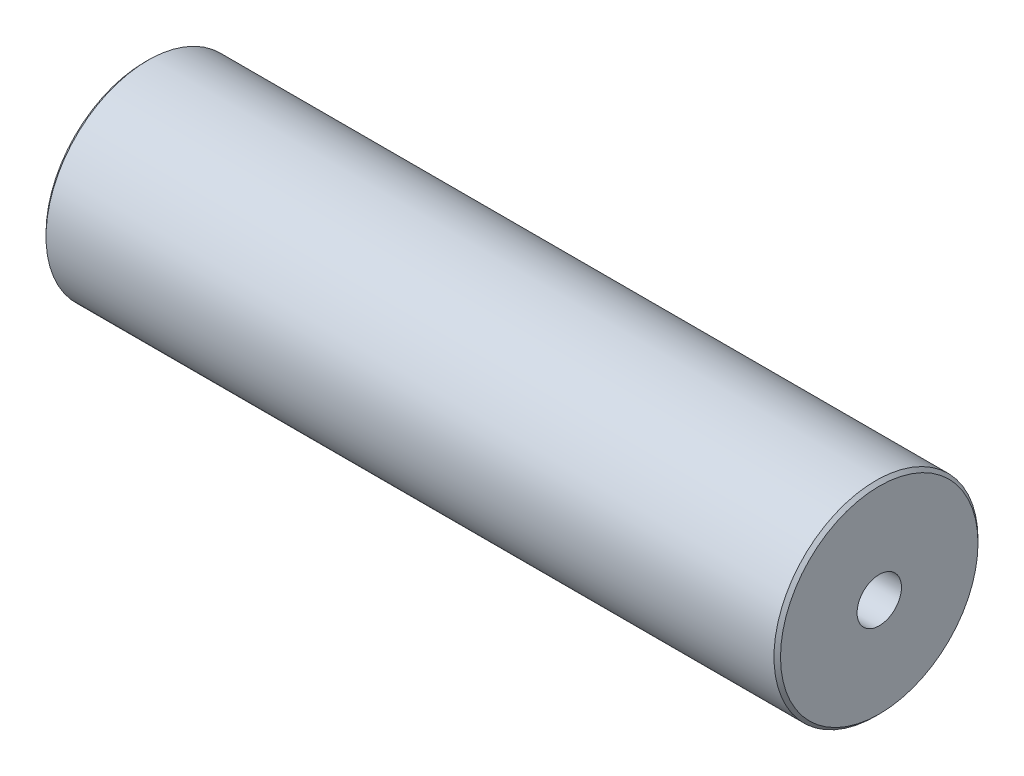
ISO-10303-21;
HEADER;
FILE_DESCRIPTION(('STEP AP214'),'2;1');
FILE_NAME('part.step','',(''),(''),'','','');
FILE_SCHEMA(('AUTOMOTIVE_DESIGN { 1 0 10303 214 1 1 1 1 }'));
ENDSEC;
DATA;
#1=APPLICATION_CONTEXT('core data for automotive mechanical design processes');
#2=APPLICATION_PROTOCOL_DEFINITION('international standard','automotive_design',2000,#1);
#3=PRODUCT_CONTEXT('',#1,'mechanical');
#4=PRODUCT('Part','Part','',(#3));
#5=PRODUCT_RELATED_PRODUCT_CATEGORY('part','',(#4));
#6=PRODUCT_DEFINITION_FORMATION('','',#4);
#7=PRODUCT_DEFINITION_CONTEXT('part definition',#1,'design');
#8=PRODUCT_DEFINITION('design','',#6,#7);
#9=PRODUCT_DEFINITION_SHAPE('','',#8);
#10=(LENGTH_UNIT() NAMED_UNIT(*) SI_UNIT(.MILLI.,.METRE.));
#11=(NAMED_UNIT(*) PLANE_ANGLE_UNIT() SI_UNIT($,.RADIAN.));
#12=(NAMED_UNIT(*) SI_UNIT($,.STERADIAN.) SOLID_ANGLE_UNIT());
#13=UNCERTAINTY_MEASURE_WITH_UNIT(LENGTH_MEASURE(1.E-05),#10,'distance_accuracy_value','');
#14=(GEOMETRIC_REPRESENTATION_CONTEXT(3) GLOBAL_UNCERTAINTY_ASSIGNED_CONTEXT((#13)) GLOBAL_UNIT_ASSIGNED_CONTEXT((#10,
#11,#12)) REPRESENTATION_CONTEXT('',''));
#15=CARTESIAN_POINT('',(0.,0.,0.));
#16=DIRECTION('',(0.,0.,1.));
#17=DIRECTION('',(1.,0.,0.));
#18=AXIS2_PLACEMENT_3D('',#15,#16,#17);
#19=CARTESIAN_POINT('',(28.575,0.,0.));
#20=DIRECTION('',(-1.,0.,0.));
#21=DIRECTION('',(0.,0.,1.));
#22=AXIS2_PLACEMENT_3D('',#19,#20,#21);
#23=CYLINDRICAL_SURFACE('',#22,7.9375);
#24=CARTESIAN_POINT('',(-28.321,0.,0.));
#25=DIRECTION('',(1.,0.,0.));
#26=DIRECTION('',(0.,0.,-1.));
#27=AXIS2_PLACEMENT_3D('',#24,#25,#26);
#28=CIRCLE('',#27,7.9375);
#29=CARTESIAN_POINT('',(-28.321,0.,-7.9375));
#30=VERTEX_POINT('',#29);
#31=EDGE_CURVE('E77',#30,#30,#28,.T.);
#32=ORIENTED_EDGE('',*,*,#31,.T.);
#33=EDGE_LOOP('',(#32));
#34=FACE_BOUND('',#33,.T.);
#35=CARTESIAN_POINT('',(28.321,0.,0.));
#36=DIRECTION('',(1.,0.,0.));
#37=DIRECTION('',(0.,0.,-1.));
#38=AXIS2_PLACEMENT_3D('',#35,#36,#37);
#39=CIRCLE('',#38,7.9375);
#40=CARTESIAN_POINT('',(28.321,0.,-7.9375));
#41=VERTEX_POINT('',#40);
#42=EDGE_CURVE('E74',#41,#41,#39,.F.);
#43=ORIENTED_EDGE('',*,*,#42,.T.);
#44=EDGE_LOOP('',(#43));
#45=FACE_BOUND('',#44,.T.);
#46=ADVANCED_FACE('F39',(#34,#45),#23,.T.);
#47=CARTESIAN_POINT('',(28.575,0.,0.));
#48=DIRECTION('',(1.,0.,0.));
#49=DIRECTION('',(0.,0.,-1.));
#50=AXIS2_PLACEMENT_3D('',#47,#48,#49);
#51=PLANE('',#50);
#52=CARTESIAN_POINT('',(28.575,0.,0.));
#53=DIRECTION('',(1.,0.,0.));
#54=DIRECTION('',(0.,0.,-1.));
#55=AXIS2_PLACEMENT_3D('',#52,#53,#54);
#56=CIRCLE('',#55,7.68350000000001);
#57=CARTESIAN_POINT('',(28.575,0.,-7.68350000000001));
#58=VERTEX_POINT('',#57);
#59=EDGE_CURVE('E11',#58,#58,#56,.T.);
#60=ORIENTED_EDGE('',*,*,#59,.T.);
#61=EDGE_LOOP('',(#60));
#62=FACE_BOUND('',#61,.T.);
#63=CARTESIAN_POINT('',(28.575,0.,0.));
#64=DIRECTION('',(1.,0.,0.));
#65=DIRECTION('',(0.,0.,-1.));
#66=AXIS2_PLACEMENT_3D('',#63,#64,#65);
#67=CIRCLE('',#66,1.7272);
#68=CARTESIAN_POINT('',(28.575,0.,-1.7272));
#69=VERTEX_POINT('',#68);
#70=EDGE_CURVE('E63',#69,#69,#67,.T.);
#71=ORIENTED_EDGE('',*,*,#70,.F.);
#72=EDGE_LOOP('',(#71));
#73=FACE_BOUND('',#72,.T.);
#74=ADVANCED_FACE('F92',(#62,#73),#51,.T.);
#75=CARTESIAN_POINT('',(-28.575,0.,0.));
#76=DIRECTION('',(1.,0.,0.));
#77=DIRECTION('',(0.,0.,-1.));
#78=AXIS2_PLACEMENT_3D('',#75,#76,#77);
#79=PLANE('',#78);
#80=CARTESIAN_POINT('',(-28.575,0.,0.));
#81=DIRECTION('',(1.,0.,0.));
#82=DIRECTION('',(0.,0.,-1.));
#83=AXIS2_PLACEMENT_3D('',#80,#81,#82);
#84=CIRCLE('',#83,7.6835);
#85=CARTESIAN_POINT('',(-28.575,0.,-7.6835));
#86=VERTEX_POINT('',#85);
#87=EDGE_CURVE('E47',#86,#86,#84,.F.);
#88=ORIENTED_EDGE('',*,*,#87,.T.);
#89=EDGE_LOOP('',(#88));
#90=FACE_BOUND('',#89,.T.);
#91=CARTESIAN_POINT('',(-28.575,0.,0.));
#92=DIRECTION('',(-1.,0.,0.));
#93=DIRECTION('',(0.,0.,1.));
#94=AXIS2_PLACEMENT_3D('',#91,#92,#93);
#95=CIRCLE('',#94,1.7272);
#96=CARTESIAN_POINT('',(-28.575,0.,1.7272));
#97=VERTEX_POINT('',#96);
#98=EDGE_CURVE('E64',#97,#97,#95,.T.);
#99=ORIENTED_EDGE('',*,*,#98,.F.);
#100=EDGE_LOOP('',(#99));
#101=FACE_BOUND('',#100,.T.);
#102=ADVANCED_FACE('F82',(#90,#101),#79,.F.);
#103=CARTESIAN_POINT('',(17.8562,0.,0.));
#104=DIRECTION('',(1.,0.,0.));
#105=DIRECTION('',(0.,0.,-1.));
#106=AXIS2_PLACEMENT_3D('',#103,#104,#105);
#107=CONICAL_SURFACE('',#106,1.7272,1.02974425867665);
#108=CARTESIAN_POINT('',(16.8183935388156,0.,0.));
#109=VERTEX_POINT('',#108);
#110=VERTEX_LOOP('',#109);
#111=FACE_BOUND('',#110,.T.);
#112=CARTESIAN_POINT('',(17.8562,0.,0.));
#113=DIRECTION('',(1.,0.,0.));
#114=DIRECTION('',(0.,0.,-1.));
#115=AXIS2_PLACEMENT_3D('',#112,#113,#114);
#116=CIRCLE('',#115,1.7272);
#117=CARTESIAN_POINT('',(17.8562,0.,-1.7272));
#118=VERTEX_POINT('',#117);
#119=EDGE_CURVE('E67',#118,#118,#116,.T.);
#120=ORIENTED_EDGE('',*,*,#119,.T.);
#121=EDGE_LOOP('',(#120));
#122=FACE_BOUND('',#121,.T.);
#123=ADVANCED_FACE('F106',(#111,#122),#107,.F.);
#124=CARTESIAN_POINT('',(28.575,0.,0.));
#125=DIRECTION('',(1.,0.,0.));
#126=DIRECTION('',(0.,0.,-1.));
#127=AXIS2_PLACEMENT_3D('',#124,#125,#126);
#128=CYLINDRICAL_SURFACE('',#127,1.7272);
#129=ORIENTED_EDGE('',*,*,#119,.F.);
#130=EDGE_LOOP('',(#129));
#131=FACE_BOUND('',#130,.T.);
#132=ORIENTED_EDGE('',*,*,#70,.T.);
#133=EDGE_LOOP('',(#132));
#134=FACE_BOUND('',#133,.T.);
#135=ADVANCED_FACE('F57',(#131,#134),#128,.F.);
#136=CARTESIAN_POINT('',(-17.8562,0.,0.));
#137=DIRECTION('',(-1.,0.,0.));
#138=DIRECTION('',(0.,0.,1.));
#139=AXIS2_PLACEMENT_3D('',#136,#137,#138);
#140=CONICAL_SURFACE('',#139,1.7272,1.02974425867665);
#141=CARTESIAN_POINT('',(-16.8183935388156,0.,0.));
#142=VERTEX_POINT('',#141);
#143=VERTEX_LOOP('',#142);
#144=FACE_BOUND('',#143,.T.);
#145=CARTESIAN_POINT('',(-17.8562,0.,0.));
#146=DIRECTION('',(-1.,0.,0.));
#147=DIRECTION('',(0.,0.,1.));
#148=AXIS2_PLACEMENT_3D('',#145,#146,#147);
#149=CIRCLE('',#148,1.7272);
#150=CARTESIAN_POINT('',(-17.8562,0.,1.7272));
#151=VERTEX_POINT('',#150);
#152=EDGE_CURVE('E61',#151,#151,#149,.T.);
#153=ORIENTED_EDGE('',*,*,#152,.T.);
#154=EDGE_LOOP('',(#153));
#155=FACE_BOUND('',#154,.T.);
#156=ADVANCED_FACE('F53',(#144,#155),#140,.F.);
#157=CARTESIAN_POINT('',(-28.575,0.,0.));
#158=DIRECTION('',(-1.,0.,0.));
#159=DIRECTION('',(0.,0.,1.));
#160=AXIS2_PLACEMENT_3D('',#157,#158,#159);
#161=CYLINDRICAL_SURFACE('',#160,1.7272);
#162=ORIENTED_EDGE('',*,*,#152,.F.);
#163=EDGE_LOOP('',(#162));
#164=FACE_BOUND('',#163,.T.);
#165=ORIENTED_EDGE('',*,*,#98,.T.);
#166=EDGE_LOOP('',(#165));
#167=FACE_BOUND('',#166,.T.);
#168=ADVANCED_FACE('F56',(#164,#167),#161,.F.);
#169=CARTESIAN_POINT('',(-28.321,0.,0.));
#170=DIRECTION('',(1.,0.,0.));
#171=DIRECTION('',(0.,0.,-1.));
#172=AXIS2_PLACEMENT_3D('',#169,#170,#171);
#173=CONICAL_SURFACE('',#172,7.9375,0.785398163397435);
#174=ORIENTED_EDGE('',*,*,#87,.F.);
#175=EDGE_LOOP('',(#174));
#176=FACE_BOUND('',#175,.T.);
#177=ORIENTED_EDGE('',*,*,#31,.F.);
#178=EDGE_LOOP('',(#177));
#179=FACE_BOUND('',#178,.T.);
#180=ADVANCED_FACE('F85',(#176,#179),#173,.T.);
#181=CARTESIAN_POINT('',(28.575,0.,0.));
#182=DIRECTION('',(-1.,0.,0.));
#183=DIRECTION('',(0.,0.,1.));
#184=AXIS2_PLACEMENT_3D('',#181,#182,#183);
#185=CONICAL_SURFACE('',#184,7.68350000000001,0.785398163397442);
#186=ORIENTED_EDGE('',*,*,#42,.F.);
#187=EDGE_LOOP('',(#186));
#188=FACE_BOUND('',#187,.T.);
#189=ORIENTED_EDGE('',*,*,#59,.F.);
#190=EDGE_LOOP('',(#189));
#191=FACE_BOUND('',#190,.T.);
#192=ADVANCED_FACE('F41',(#188,#191),#185,.T.);
#193=CLOSED_SHELL('',(#46,#74,#102,#123,#135,#156,#168,#180,#192));
#194=MANIFOLD_SOLID_BREP('B2',#193);
#195=ADVANCED_BREP_SHAPE_REPRESENTATION('',(#18,#194),#14);
#196=SHAPE_DEFINITION_REPRESENTATION(#9,#195);
ENDSEC;
END-ISO-10303-21;
